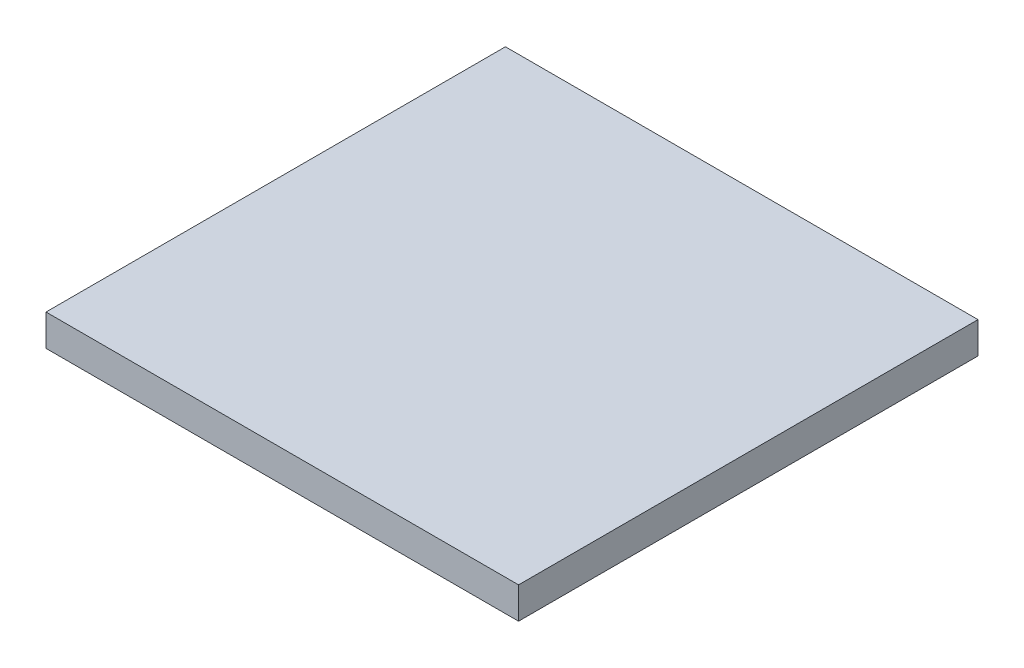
ISO-10303-21;
HEADER;
FILE_DESCRIPTION(('STEP AP214'),'2;1');
FILE_NAME('part.step','',(''),(''),'','','');
FILE_SCHEMA(('AUTOMOTIVE_DESIGN { 1 0 10303 214 1 1 1 1 }'));
ENDSEC;
DATA;
#1=APPLICATION_CONTEXT('core data for automotive mechanical design processes');
#2=APPLICATION_PROTOCOL_DEFINITION('international standard','automotive_design',2000,#1);
#3=PRODUCT_CONTEXT('',#1,'mechanical');
#4=PRODUCT('Part','Part','',(#3));
#5=PRODUCT_RELATED_PRODUCT_CATEGORY('part','',(#4));
#6=PRODUCT_DEFINITION_FORMATION('','',#4);
#7=PRODUCT_DEFINITION_CONTEXT('part definition',#1,'design');
#8=PRODUCT_DEFINITION('design','',#6,#7);
#9=PRODUCT_DEFINITION_SHAPE('','',#8);
#10=(LENGTH_UNIT() NAMED_UNIT(*) SI_UNIT(.MILLI.,.METRE.));
#11=(NAMED_UNIT(*) PLANE_ANGLE_UNIT() SI_UNIT($,.RADIAN.));
#12=(NAMED_UNIT(*) SI_UNIT($,.STERADIAN.) SOLID_ANGLE_UNIT());
#13=UNCERTAINTY_MEASURE_WITH_UNIT(LENGTH_MEASURE(1.E-05),#10,'distance_accuracy_value','');
#14=(GEOMETRIC_REPRESENTATION_CONTEXT(3) GLOBAL_UNCERTAINTY_ASSIGNED_CONTEXT((#13)) GLOBAL_UNIT_ASSIGNED_CONTEXT((#10,
#11,#12)) REPRESENTATION_CONTEXT('',''));
#15=CARTESIAN_POINT('',(0.,0.,0.));
#16=DIRECTION('',(0.,0.,1.));
#17=DIRECTION('',(1.,0.,0.));
#18=AXIS2_PLACEMENT_3D('',#15,#16,#17);
#19=CARTESIAN_POINT('',(0.,12.,0.));
#20=DIRECTION('',(1.,0.,0.));
#21=DIRECTION('',(0.,0.,-1.));
#22=AXIS2_PLACEMENT_3D('',#19,#20,#21);
#23=PLANE('',#22);
#24=DIRECTION('',(0.,0.,1.));
#25=VECTOR('',#24,1.);
#26=CARTESIAN_POINT('',(0.,0.,0.));
#27=LINE('',#26,#25);
#28=CARTESIAN_POINT('',(0.,0.,-175.));
#29=VERTEX_POINT('',#28);
#30=CARTESIAN_POINT('',(0.,0.,0.));
#31=VERTEX_POINT('',#30);
#32=EDGE_CURVE('E107',#29,#31,#27,.T.);
#33=ORIENTED_EDGE('',*,*,#32,.T.);
#34=DIRECTION('',(0.,-1.,0.));
#35=VECTOR('',#34,1.);
#36=CARTESIAN_POINT('',(0.,12.,0.));
#37=LINE('',#36,#35);
#38=CARTESIAN_POINT('',(0.,12.,0.));
#39=VERTEX_POINT('',#38);
#40=EDGE_CURVE('E11',#39,#31,#37,.T.);
#41=ORIENTED_EDGE('',*,*,#40,.F.);
#42=DIRECTION('',(0.,0.,1.));
#43=VECTOR('',#42,1.);
#44=CARTESIAN_POINT('',(0.,12.,0.));
#45=LINE('',#44,#43);
#46=CARTESIAN_POINT('',(0.,12.,-175.));
#47=VERTEX_POINT('',#46);
#48=EDGE_CURVE('E91',#47,#39,#45,.T.);
#49=ORIENTED_EDGE('',*,*,#48,.F.);
#50=DIRECTION('',(0.,-1.,0.));
#51=VECTOR('',#50,1.);
#52=CARTESIAN_POINT('',(0.,12.,-175.));
#53=LINE('',#52,#51);
#54=EDGE_CURVE('E103',#47,#29,#53,.T.);
#55=ORIENTED_EDGE('',*,*,#54,.T.);
#56=EDGE_LOOP('',(#33,#41,#49,#55));
#57=FACE_BOUND('',#56,.T.);
#58=ADVANCED_FACE('F39',(#57),#23,.F.);
#59=CARTESIAN_POINT('',(0.,12.,0.));
#60=DIRECTION('',(0.,0.,-1.));
#61=DIRECTION('',(-1.,0.,0.));
#62=AXIS2_PLACEMENT_3D('',#59,#60,#61);
#63=PLANE('',#62);
#64=DIRECTION('',(1.,0.,0.));
#65=VECTOR('',#64,1.);
#66=CARTESIAN_POINT('',(0.,0.,0.));
#67=LINE('',#66,#65);
#68=CARTESIAN_POINT('',(180.,0.,0.));
#69=VERTEX_POINT('',#68);
#70=EDGE_CURVE('E96',#31,#69,#67,.T.);
#71=ORIENTED_EDGE('',*,*,#70,.T.);
#72=DIRECTION('',(0.,-1.,0.));
#73=VECTOR('',#72,1.);
#74=CARTESIAN_POINT('',(180.,12.,0.));
#75=LINE('',#74,#73);
#76=CARTESIAN_POINT('',(180.,12.,0.));
#77=VERTEX_POINT('',#76);
#78=EDGE_CURVE('E48',#77,#69,#75,.T.);
#79=ORIENTED_EDGE('',*,*,#78,.F.);
#80=DIRECTION('',(1.,0.,0.));
#81=VECTOR('',#80,1.);
#82=CARTESIAN_POINT('',(0.,12.,0.));
#83=LINE('',#82,#81);
#84=EDGE_CURVE('E86',#39,#77,#83,.T.);
#85=ORIENTED_EDGE('',*,*,#84,.F.);
#86=ORIENTED_EDGE('',*,*,#40,.T.);
#87=EDGE_LOOP('',(#71,#79,#85,#86));
#88=FACE_BOUND('',#87,.T.);
#89=ADVANCED_FACE('F95',(#88),#63,.F.);
#90=CARTESIAN_POINT('',(180.,12.,0.));
#91=DIRECTION('',(-1.,0.,0.));
#92=DIRECTION('',(0.,0.,1.));
#93=AXIS2_PLACEMENT_3D('',#90,#91,#92);
#94=PLANE('',#93);
#95=DIRECTION('',(0.,0.,-1.));
#96=VECTOR('',#95,1.);
#97=CARTESIAN_POINT('',(180.,0.,0.));
#98=LINE('',#97,#96);
#99=CARTESIAN_POINT('',(180.,0.,-175.));
#100=VERTEX_POINT('',#99);
#101=EDGE_CURVE('E73',#69,#100,#98,.T.);
#102=ORIENTED_EDGE('',*,*,#101,.T.);
#103=DIRECTION('',(0.,-1.,0.));
#104=VECTOR('',#103,1.);
#105=CARTESIAN_POINT('',(180.,12.,-175.));
#106=LINE('',#105,#104);
#107=CARTESIAN_POINT('',(180.,12.,-175.));
#108=VERTEX_POINT('',#107);
#109=EDGE_CURVE('E98',#108,#100,#106,.T.);
#110=ORIENTED_EDGE('',*,*,#109,.F.);
#111=DIRECTION('',(0.,0.,-1.));
#112=VECTOR('',#111,1.);
#113=CARTESIAN_POINT('',(180.,12.,0.));
#114=LINE('',#113,#112);
#115=EDGE_CURVE('E89',#77,#108,#114,.T.);
#116=ORIENTED_EDGE('',*,*,#115,.F.);
#117=ORIENTED_EDGE('',*,*,#78,.T.);
#118=EDGE_LOOP('',(#102,#110,#116,#117));
#119=FACE_BOUND('',#118,.T.);
#120=ADVANCED_FACE('F99',(#119),#94,.F.);
#121=CARTESIAN_POINT('',(0.,12.,-175.));
#122=DIRECTION('',(0.,0.,1.));
#123=DIRECTION('',(1.,0.,0.));
#124=AXIS2_PLACEMENT_3D('',#121,#122,#123);
#125=PLANE('',#124);
#126=DIRECTION('',(-1.,0.,0.));
#127=VECTOR('',#126,1.);
#128=CARTESIAN_POINT('',(0.,0.,-175.));
#129=LINE('',#128,#127);
#130=EDGE_CURVE('E79',#100,#29,#129,.T.);
#131=ORIENTED_EDGE('',*,*,#130,.T.);
#132=ORIENTED_EDGE('',*,*,#54,.F.);
#133=DIRECTION('',(-1.,0.,0.));
#134=VECTOR('',#133,1.);
#135=CARTESIAN_POINT('',(0.,12.,-175.));
#136=LINE('',#135,#134);
#137=EDGE_CURVE('E56',#108,#47,#136,.T.);
#138=ORIENTED_EDGE('',*,*,#137,.F.);
#139=ORIENTED_EDGE('',*,*,#109,.T.);
#140=EDGE_LOOP('',(#131,#132,#138,#139));
#141=FACE_BOUND('',#140,.T.);
#142=ADVANCED_FACE('F120',(#141),#125,.F.);
#143=CARTESIAN_POINT('',(0.,12.,0.));
#144=DIRECTION('',(0.,-1.,0.));
#145=DIRECTION('',(0.,0.,-1.));
#146=AXIS2_PLACEMENT_3D('',#143,#144,#145);
#147=PLANE('',#146);
#148=ORIENTED_EDGE('',*,*,#48,.T.);
#149=ORIENTED_EDGE('',*,*,#84,.T.);
#150=ORIENTED_EDGE('',*,*,#115,.T.);
#151=ORIENTED_EDGE('',*,*,#137,.T.);
#152=EDGE_LOOP('',(#148,#149,#150,#151));
#153=FACE_BOUND('',#152,.T.);
#154=ADVANCED_FACE('F87',(#153),#147,.F.);
#155=CARTESIAN_POINT('',(0.,0.,0.));
#156=DIRECTION('',(0.,-1.,0.));
#157=DIRECTION('',(0.,0.,-1.));
#158=AXIS2_PLACEMENT_3D('',#155,#156,#157);
#159=PLANE('',#158);
#160=ORIENTED_EDGE('',*,*,#32,.F.);
#161=ORIENTED_EDGE('',*,*,#130,.F.);
#162=ORIENTED_EDGE('',*,*,#101,.F.);
#163=ORIENTED_EDGE('',*,*,#70,.F.);
#164=EDGE_LOOP('',(#160,#161,#162,#163));
#165=FACE_BOUND('',#164,.T.);
#166=ADVANCED_FACE('F123',(#165),#159,.T.);
#167=CLOSED_SHELL('',(#58,#89,#120,#142,#154,#166));
#168=MANIFOLD_SOLID_BREP('B2',#167);
#169=ADVANCED_BREP_SHAPE_REPRESENTATION('',(#18,#168),#14);
#170=SHAPE_DEFINITION_REPRESENTATION(#9,#169);
ENDSEC;
END-ISO-10303-21;
